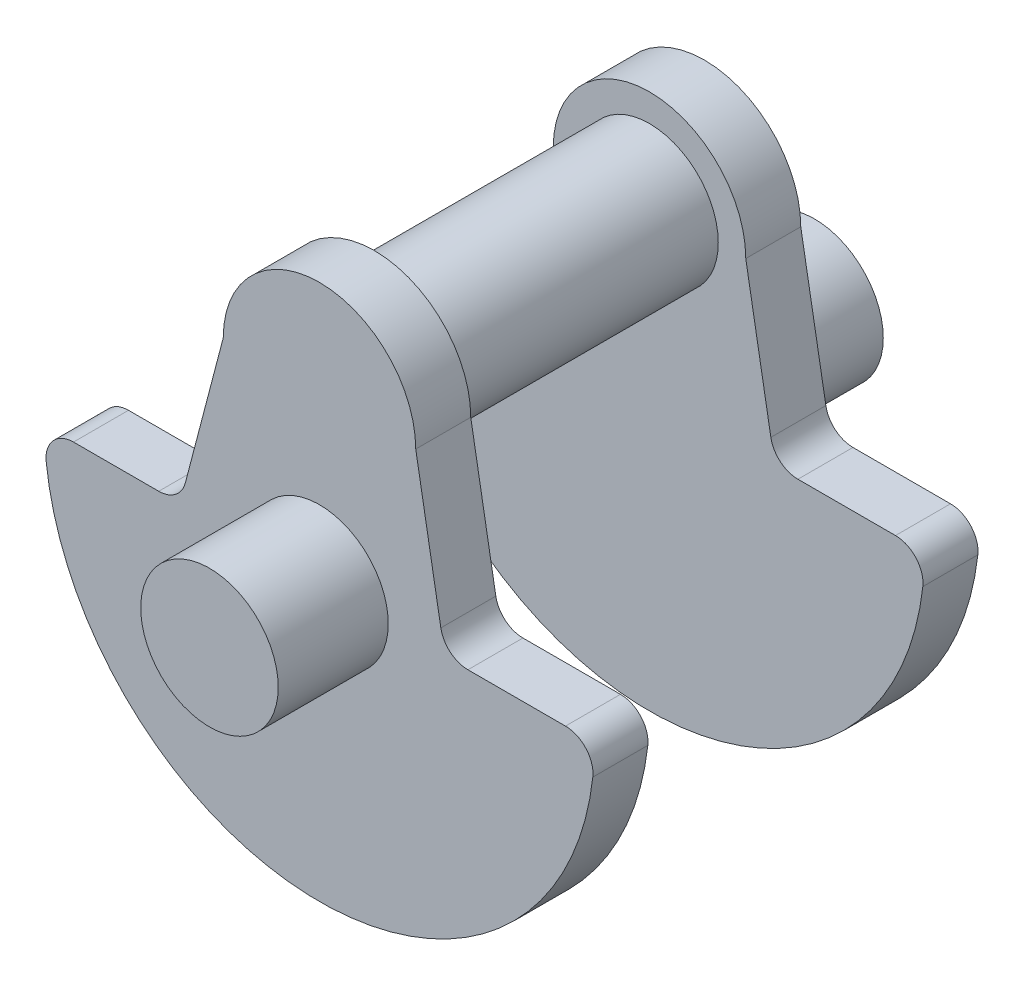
ISO-10303-21;
HEADER;
FILE_DESCRIPTION(('STEP AP214'),'2;1');
FILE_NAME('part.step','',(''),(''),'','','');
FILE_SCHEMA(('AUTOMOTIVE_DESIGN { 1 0 10303 214 1 1 1 1 }'));
ENDSEC;
DATA;
#1=APPLICATION_CONTEXT('core data for automotive mechanical design processes');
#2=APPLICATION_PROTOCOL_DEFINITION('international standard','automotive_design',2000,#1);
#3=PRODUCT_CONTEXT('',#1,'mechanical');
#4=PRODUCT('Part','Part','',(#3));
#5=PRODUCT_RELATED_PRODUCT_CATEGORY('part','',(#4));
#6=PRODUCT_DEFINITION_FORMATION('','',#4);
#7=PRODUCT_DEFINITION_CONTEXT('part definition',#1,'design');
#8=PRODUCT_DEFINITION('design','',#6,#7);
#9=PRODUCT_DEFINITION_SHAPE('','',#8);
#10=(LENGTH_UNIT() NAMED_UNIT(*) SI_UNIT(.MILLI.,.METRE.));
#11=(NAMED_UNIT(*) PLANE_ANGLE_UNIT() SI_UNIT($,.RADIAN.));
#12=(NAMED_UNIT(*) SI_UNIT($,.STERADIAN.) SOLID_ANGLE_UNIT());
#13=UNCERTAINTY_MEASURE_WITH_UNIT(LENGTH_MEASURE(1.E-05),#10,'distance_accuracy_value','');
#14=(GEOMETRIC_REPRESENTATION_CONTEXT(3) GLOBAL_UNCERTAINTY_ASSIGNED_CONTEXT((#13)) GLOBAL_UNIT_ASSIGNED_CONTEXT((#10,
#11,#12)) REPRESENTATION_CONTEXT('',''));
#15=CARTESIAN_POINT('',(0.,0.,0.));
#16=DIRECTION('',(0.,0.,1.));
#17=DIRECTION('',(1.,0.,0.));
#18=AXIS2_PLACEMENT_3D('',#15,#16,#17);
#19=CARTESIAN_POINT('',(0.,30.,-10.));
#20=DIRECTION('',(0.,0.,1.));
#21=DIRECTION('',(1.,0.,0.));
#22=AXIS2_PLACEMENT_3D('',#19,#20,#21);
#23=CYLINDRICAL_SURFACE('',#22,17.5);
#24=CARTESIAN_POINT('',(0.,30.,0.));
#25=DIRECTION('',(0.,0.,1.));
#26=DIRECTION('',(1.,0.,0.));
#27=AXIS2_PLACEMENT_3D('',#24,#25,#26);
#28=CIRCLE('',#27,17.5);
#29=CARTESIAN_POINT('',(17.5,30.,0.));
#30=VERTEX_POINT('',#29);
#31=CARTESIAN_POINT('',(-17.5,30.,0.));
#32=VERTEX_POINT('',#31);
#33=EDGE_CURVE('E232',#30,#32,#28,.T.);
#34=ORIENTED_EDGE('',*,*,#33,.F.);
#35=DIRECTION('',(0.,0.,1.));
#36=VECTOR('',#35,1.);
#37=CARTESIAN_POINT('',(17.5,30.,-10.));
#38=LINE('',#37,#36);
#39=CARTESIAN_POINT('',(17.5,30.,-10.));
#40=VERTEX_POINT('',#39);
#41=EDGE_CURVE('E272',#40,#30,#38,.T.);
#42=ORIENTED_EDGE('',*,*,#41,.F.);
#43=CARTESIAN_POINT('',(0.,30.,-10.));
#44=DIRECTION('',(0.,0.,1.));
#45=DIRECTION('',(1.,0.,0.));
#46=AXIS2_PLACEMENT_3D('',#43,#44,#45);
#47=CIRCLE('',#46,17.5);
#48=CARTESIAN_POINT('',(-17.5,30.,-10.));
#49=VERTEX_POINT('',#48);
#50=EDGE_CURVE('E238',#40,#49,#47,.T.);
#51=ORIENTED_EDGE('',*,*,#50,.T.);
#52=DIRECTION('',(0.,0.,1.));
#53=VECTOR('',#52,1.);
#54=CARTESIAN_POINT('',(-17.5,30.,-10.));
#55=LINE('',#54,#53);
#56=EDGE_CURVE('E256',#49,#32,#55,.T.);
#57=ORIENTED_EDGE('',*,*,#56,.T.);
#58=EDGE_LOOP('',(#34,#42,#51,#57));
#59=FACE_BOUND('',#58,.T.);
#60=ADVANCED_FACE('F38',(#59),#23,.T.);
#61=CARTESIAN_POINT('',(22.1026125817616,3.8972869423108,-10.));
#62=DIRECTION('',(0.984807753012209,0.173648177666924,0.));
#63=DIRECTION('',(-0.173648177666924,0.984807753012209,0.));
#64=AXIS2_PLACEMENT_3D('',#61,#62,#63);
#65=PLANE('',#64);
#66=DIRECTION('',(-0.173648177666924,0.984807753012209,0.));
#67=VECTOR('',#66,1.);
#68=CARTESIAN_POINT('',(22.1026125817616,3.8972869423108,0.));
#69=LINE('',#68,#67);
#70=CARTESIAN_POINT('',(22.0612688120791,4.13175911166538,0.));
#71=VERTEX_POINT('',#70);
#72=EDGE_CURVE('E242',#71,#30,#69,.T.);
#73=ORIENTED_EDGE('',*,*,#72,.F.);
#74=DIRECTION('',(0.,0.,1.));
#75=VECTOR('',#74,1.);
#76=CARTESIAN_POINT('',(22.0612688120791,4.13175911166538,-10.));
#77=LINE('',#76,#75);
#78=CARTESIAN_POINT('',(22.0612688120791,4.13175911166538,-10.));
#79=VERTEX_POINT('',#78);
#80=EDGE_CURVE('E302',#71,#79,#77,.F.);
#81=ORIENTED_EDGE('',*,*,#80,.T.);
#82=DIRECTION('',(-0.173648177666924,0.984807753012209,0.));
#83=VECTOR('',#82,1.);
#84=CARTESIAN_POINT('',(22.1026125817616,3.8972869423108,-10.));
#85=LINE('',#84,#83);
#86=EDGE_CURVE('E254',#79,#40,#85,.T.);
#87=ORIENTED_EDGE('',*,*,#86,.T.);
#88=ORIENTED_EDGE('',*,*,#41,.T.);
#89=EDGE_LOOP('',(#73,#81,#87,#88));
#90=FACE_BOUND('',#89,.T.);
#91=ADVANCED_FACE('F366',(#90),#65,.T.);
#92=CARTESIAN_POINT('',(0.,0.,-10.));
#93=DIRECTION('',(0.,1.,0.));
#94=DIRECTION('',(-1.,0.,0.));
#95=AXIS2_PLACEMENT_3D('',#92,#93,#94);
#96=PLANE('',#95);
#97=DIRECTION('',(-1.,0.,0.));
#98=VECTOR('',#97,1.);
#99=CARTESIAN_POINT('',(0.,0.,0.));
#100=LINE('',#99,#98);
#101=CARTESIAN_POINT('',(44.7213595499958,0.,0.));
#102=VERTEX_POINT('',#101);
#103=CARTESIAN_POINT('',(26.9853075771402,0.,0.));
#104=VERTEX_POINT('',#103);
#105=EDGE_CURVE('E268',#102,#104,#100,.T.);
#106=ORIENTED_EDGE('',*,*,#105,.F.);
#107=DIRECTION('',(0.,0.,1.));
#108=VECTOR('',#107,1.);
#109=CARTESIAN_POINT('',(44.7213595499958,0.,-10.));
#110=LINE('',#109,#108);
#111=CARTESIAN_POINT('',(44.7213595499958,0.,-10.));
#112=VERTEX_POINT('',#111);
#113=EDGE_CURVE('E296',#102,#112,#110,.F.);
#114=ORIENTED_EDGE('',*,*,#113,.T.);
#115=DIRECTION('',(-1.,0.,0.));
#116=VECTOR('',#115,1.);
#117=CARTESIAN_POINT('',(0.,0.,-10.));
#118=LINE('',#117,#116);
#119=CARTESIAN_POINT('',(26.9853075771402,0.,-10.));
#120=VERTEX_POINT('',#119);
#121=EDGE_CURVE('E251',#112,#120,#118,.T.);
#122=ORIENTED_EDGE('',*,*,#121,.T.);
#123=DIRECTION('',(0.,0.,1.));
#124=VECTOR('',#123,1.);
#125=CARTESIAN_POINT('',(26.9853075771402,0.,0.));
#126=LINE('',#125,#124);
#127=EDGE_CURVE('E293',#120,#104,#126,.T.);
#128=ORIENTED_EDGE('',*,*,#127,.T.);
#129=EDGE_LOOP('',(#106,#114,#122,#128));
#130=FACE_BOUND('',#129,.T.);
#131=ADVANCED_FACE('F372',(#130),#96,.T.);
#132=CARTESIAN_POINT('',(0.,0.,-10.));
#133=DIRECTION('',(0.,0.,1.));
#134=DIRECTION('',(1.,0.,0.));
#135=AXIS2_PLACEMENT_3D('',#132,#133,#134);
#136=CYLINDRICAL_SURFACE('',#135,50.);
#137=CARTESIAN_POINT('',(0.,0.,-10.));
#138=DIRECTION('',(0.,0.,1.));
#139=DIRECTION('',(1.,0.,0.));
#140=AXIS2_PLACEMENT_3D('',#137,#138,#139);
#141=CIRCLE('',#140,50.);
#142=CARTESIAN_POINT('',(-49.6903994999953,-5.55555555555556,-10.));
#143=VERTEX_POINT('',#142);
#144=CARTESIAN_POINT('',(49.6903994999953,-5.55555555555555,-10.));
#145=VERTEX_POINT('',#144);
#146=EDGE_CURVE('E248',#143,#145,#141,.T.);
#147=ORIENTED_EDGE('',*,*,#146,.T.);
#148=DIRECTION('',(0.,0.,1.));
#149=VECTOR('',#148,1.);
#150=CARTESIAN_POINT('',(49.6903994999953,-5.55555555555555,-10.));
#151=LINE('',#150,#149);
#152=CARTESIAN_POINT('',(49.6903994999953,-5.55555555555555,0.));
#153=VERTEX_POINT('',#152);
#154=EDGE_CURVE('E286',#145,#153,#151,.T.);
#155=ORIENTED_EDGE('',*,*,#154,.T.);
#156=CARTESIAN_POINT('',(0.,0.,0.));
#157=DIRECTION('',(0.,0.,1.));
#158=DIRECTION('',(1.,0.,0.));
#159=AXIS2_PLACEMENT_3D('',#156,#157,#158);
#160=CIRCLE('',#159,50.);
#161=CARTESIAN_POINT('',(-49.6903994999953,-5.55555555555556,0.));
#162=VERTEX_POINT('',#161);
#163=EDGE_CURVE('E265',#162,#153,#160,.T.);
#164=ORIENTED_EDGE('',*,*,#163,.F.);
#165=DIRECTION('',(0.,0.,1.));
#166=VECTOR('',#165,1.);
#167=CARTESIAN_POINT('',(-49.6903994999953,-5.55555555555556,-10.));
#168=LINE('',#167,#166);
#169=EDGE_CURVE('E284',#162,#143,#168,.F.);
#170=ORIENTED_EDGE('',*,*,#169,.T.);
#171=EDGE_LOOP('',(#147,#155,#164,#170));
#172=FACE_BOUND('',#171,.T.);
#173=ADVANCED_FACE('F456',(#172),#136,.T.);
#174=CARTESIAN_POINT('',(0.,0.,-10.));
#175=DIRECTION('',(0.,1.,0.));
#176=DIRECTION('',(-1.,0.,0.));
#177=AXIS2_PLACEMENT_3D('',#174,#175,#176);
#178=PLANE('',#177);
#179=DIRECTION('',(-1.,0.,0.));
#180=VECTOR('',#179,1.);
#181=CARTESIAN_POINT('',(0.,0.,0.));
#182=LINE('',#181,#180);
#183=CARTESIAN_POINT('',(-29.2245136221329,0.,0.));
#184=VERTEX_POINT('',#183);
#185=CARTESIAN_POINT('',(-44.7213595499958,0.,0.));
#186=VERTEX_POINT('',#185);
#187=EDGE_CURVE('E262',#184,#186,#182,.T.);
#188=ORIENTED_EDGE('',*,*,#187,.F.);
#189=DIRECTION('',(0.,0.,1.));
#190=VECTOR('',#189,1.);
#191=CARTESIAN_POINT('',(-29.2245136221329,0.,-10.));
#192=LINE('',#191,#190);
#193=CARTESIAN_POINT('',(-29.2245136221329,0.,-10.));
#194=VERTEX_POINT('',#193);
#195=EDGE_CURVE('E282',#184,#194,#192,.F.);
#196=ORIENTED_EDGE('',*,*,#195,.T.);
#197=DIRECTION('',(-1.,0.,0.));
#198=VECTOR('',#197,1.);
#199=CARTESIAN_POINT('',(0.,0.,-10.));
#200=LINE('',#199,#198);
#201=CARTESIAN_POINT('',(-44.7213595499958,0.,-10.));
#202=VERTEX_POINT('',#201);
#203=EDGE_CURVE('E245',#194,#202,#200,.T.);
#204=ORIENTED_EDGE('',*,*,#203,.T.);
#205=DIRECTION('',(0.,0.,1.));
#206=VECTOR('',#205,1.);
#207=CARTESIAN_POINT('',(-44.7213595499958,0.,-10.));
#208=LINE('',#207,#206);
#209=EDGE_CURVE('E279',#202,#186,#208,.T.);
#210=ORIENTED_EDGE('',*,*,#209,.T.);
#211=EDGE_LOOP('',(#188,#196,#204,#210));
#212=FACE_BOUND('',#211,.T.);
#213=ADVANCED_FACE('F459',(#212),#178,.T.);
#214=CARTESIAN_POINT('',(-23.7346062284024,6.22366385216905,-10.));
#215=DIRECTION('',(-0.967297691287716,0.253643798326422,0.));
#216=DIRECTION('',(-0.253643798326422,-0.967297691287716,0.));
#217=AXIS2_PLACEMENT_3D('',#214,#215,#216);
#218=PLANE('',#217);
#219=DIRECTION('',(-0.253643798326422,-0.967297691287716,0.));
#220=VECTOR('',#219,1.);
#221=CARTESIAN_POINT('',(-23.7346062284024,6.22366385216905,-10.));
#222=LINE('',#221,#220);
#223=CARTESIAN_POINT('',(-24.3880251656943,3.73178100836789,-10.));
#224=VERTEX_POINT('',#223);
#225=EDGE_CURVE('E241',#49,#224,#222,.T.);
#226=ORIENTED_EDGE('',*,*,#225,.T.);
#227=DIRECTION('',(0.,0.,1.));
#228=VECTOR('',#227,1.);
#229=CARTESIAN_POINT('',(-24.3880251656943,3.73178100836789,0.));
#230=LINE('',#229,#228);
#231=CARTESIAN_POINT('',(-24.3880251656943,3.73178100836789,0.));
#232=VERTEX_POINT('',#231);
#233=EDGE_CURVE('E275',#224,#232,#230,.T.);
#234=ORIENTED_EDGE('',*,*,#233,.T.);
#235=DIRECTION('',(-0.253643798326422,-0.967297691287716,0.));
#236=VECTOR('',#235,1.);
#237=CARTESIAN_POINT('',(-23.7346062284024,6.22366385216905,0.));
#238=LINE('',#237,#236);
#239=EDGE_CURVE('E259',#32,#232,#238,.T.);
#240=ORIENTED_EDGE('',*,*,#239,.F.);
#241=ORIENTED_EDGE('',*,*,#56,.F.);
#242=EDGE_LOOP('',(#226,#234,#240,#241));
#243=FACE_BOUND('',#242,.T.);
#244=ADVANCED_FACE('F378',(#243),#218,.T.);
#245=CARTESIAN_POINT('',(0.,0.,-10.));
#246=DIRECTION('',(0.,0.,1.));
#247=DIRECTION('',(1.,0.,0.));
#248=AXIS2_PLACEMENT_3D('',#245,#246,#247);
#249=PLANE('',#248);
#250=CARTESIAN_POINT('',(0.,30.,-10.));
#251=DIRECTION('',(0.,0.,1.));
#252=DIRECTION('',(1.,0.,0.));
#253=AXIS2_PLACEMENT_3D('',#250,#251,#252);
#254=CIRCLE('',#253,12.5);
#255=CARTESIAN_POINT('',(12.5,30.,-10.));
#256=VERTEX_POINT('',#255);
#257=EDGE_CURVE('E236',#256,#256,#254,.F.);
#258=ORIENTED_EDGE('',*,*,#257,.F.);
#259=EDGE_LOOP('',(#258));
#260=FACE_BOUND('',#259,.T.);
#261=ORIENTED_EDGE('',*,*,#121,.F.);
#262=CARTESIAN_POINT('',(44.7213595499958,-5.,-10.));
#263=DIRECTION('',(0.,0.,1.));
#264=DIRECTION('',(1.,0.,0.));
#265=AXIS2_PLACEMENT_3D('',#262,#263,#264);
#266=CIRCLE('',#265,5.);
#267=EDGE_CURVE('E300',#112,#145,#266,.F.);
#268=ORIENTED_EDGE('',*,*,#267,.T.);
#269=ORIENTED_EDGE('',*,*,#146,.F.);
#270=CARTESIAN_POINT('',(-44.7213595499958,-5.00000000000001,-10.));
#271=DIRECTION('',(0.,0.,1.));
#272=DIRECTION('',(1.,0.,0.));
#273=AXIS2_PLACEMENT_3D('',#270,#271,#272);
#274=CIRCLE('',#273,5.);
#275=EDGE_CURVE('E298',#143,#202,#274,.F.);
#276=ORIENTED_EDGE('',*,*,#275,.T.);
#277=ORIENTED_EDGE('',*,*,#203,.F.);
#278=CARTESIAN_POINT('',(-29.2245136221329,5.,-10.));
#279=DIRECTION('',(0.,0.,1.));
#280=DIRECTION('',(1.,0.,0.));
#281=AXIS2_PLACEMENT_3D('',#278,#279,#280);
#282=CIRCLE('',#281,5.);
#283=EDGE_CURVE('E306',#194,#224,#282,.T.);
#284=ORIENTED_EDGE('',*,*,#283,.T.);
#285=ORIENTED_EDGE('',*,*,#225,.F.);
#286=ORIENTED_EDGE('',*,*,#50,.F.);
#287=ORIENTED_EDGE('',*,*,#86,.F.);
#288=CARTESIAN_POINT('',(26.9853075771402,5.,-10.));
#289=DIRECTION('',(0.,0.,1.));
#290=DIRECTION('',(1.,0.,0.));
#291=AXIS2_PLACEMENT_3D('',#288,#289,#290);
#292=CIRCLE('',#291,5.);
#293=EDGE_CURVE('E237',#79,#120,#292,.T.);
#294=ORIENTED_EDGE('',*,*,#293,.T.);
#295=EDGE_LOOP('',(#261,#268,#269,#276,#277,#284,#285,#286,#287,#294));
#296=FACE_BOUND('',#295,.T.);
#297=ADVANCED_FACE('F447',(#260,#296),#249,.F.);
#298=CARTESIAN_POINT('',(0.,0.,0.));
#299=DIRECTION('',(0.,0.,1.));
#300=DIRECTION('',(1.,0.,0.));
#301=AXIS2_PLACEMENT_3D('',#298,#299,#300);
#302=PLANE('',#301);
#303=CARTESIAN_POINT('',(0.,0.,0.));
#304=DIRECTION('',(0.,0.,1.));
#305=DIRECTION('',(1.,0.,0.));
#306=AXIS2_PLACEMENT_3D('',#303,#304,#305);
#307=CIRCLE('',#306,12.5);
#308=CARTESIAN_POINT('',(12.5,0.,0.));
#309=VERTEX_POINT('',#308);
#310=EDGE_CURVE('E233',#309,#309,#307,.T.);
#311=ORIENTED_EDGE('',*,*,#310,.F.);
#312=EDGE_LOOP('',(#311));
#313=FACE_BOUND('',#312,.T.);
#314=ORIENTED_EDGE('',*,*,#163,.T.);
#315=CARTESIAN_POINT('',(44.7213595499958,-5.,0.));
#316=DIRECTION('',(0.,0.,1.));
#317=DIRECTION('',(1.,0.,0.));
#318=AXIS2_PLACEMENT_3D('',#315,#316,#317);
#319=CIRCLE('',#318,5.);
#320=EDGE_CURVE('E291',#153,#102,#319,.T.);
#321=ORIENTED_EDGE('',*,*,#320,.T.);
#322=ORIENTED_EDGE('',*,*,#105,.T.);
#323=CARTESIAN_POINT('',(26.9853075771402,5.,0.));
#324=DIRECTION('',(0.,0.,1.));
#325=DIRECTION('',(1.,0.,0.));
#326=AXIS2_PLACEMENT_3D('',#323,#324,#325);
#327=CIRCLE('',#326,5.);
#328=EDGE_CURVE('E308',#104,#71,#327,.F.);
#329=ORIENTED_EDGE('',*,*,#328,.T.);
#330=ORIENTED_EDGE('',*,*,#72,.T.);
#331=ORIENTED_EDGE('',*,*,#33,.T.);
#332=ORIENTED_EDGE('',*,*,#239,.T.);
#333=CARTESIAN_POINT('',(-29.2245136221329,5.,0.));
#334=DIRECTION('',(0.,0.,1.));
#335=DIRECTION('',(1.,0.,0.));
#336=AXIS2_PLACEMENT_3D('',#333,#334,#335);
#337=CIRCLE('',#336,5.);
#338=EDGE_CURVE('E304',#232,#184,#337,.F.);
#339=ORIENTED_EDGE('',*,*,#338,.T.);
#340=ORIENTED_EDGE('',*,*,#187,.T.);
#341=CARTESIAN_POINT('',(-44.7213595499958,-5.00000000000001,0.));
#342=DIRECTION('',(0.,0.,1.));
#343=DIRECTION('',(1.,0.,0.));
#344=AXIS2_PLACEMENT_3D('',#341,#342,#343);
#345=CIRCLE('',#344,5.);
#346=EDGE_CURVE('E289',#186,#162,#345,.T.);
#347=ORIENTED_EDGE('',*,*,#346,.T.);
#348=EDGE_LOOP('',(#314,#321,#322,#329,#330,#331,#332,#339,#340,#347));
#349=FACE_BOUND('',#348,.T.);
#350=ADVANCED_FACE('F384',(#313,#349),#302,.T.);
#351=CARTESIAN_POINT('',(-29.2245136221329,5.,-10.));
#352=DIRECTION('',(0.,0.,-1.));
#353=DIRECTION('',(-1.,0.,0.));
#354=AXIS2_PLACEMENT_3D('',#351,#352,#353);
#355=CYLINDRICAL_SURFACE('',#354,5.);
#356=ORIENTED_EDGE('',*,*,#283,.F.);
#357=ORIENTED_EDGE('',*,*,#195,.F.);
#358=ORIENTED_EDGE('',*,*,#338,.F.);
#359=ORIENTED_EDGE('',*,*,#233,.F.);
#360=EDGE_LOOP('',(#356,#357,#358,#359));
#361=FACE_BOUND('',#360,.T.);
#362=ADVANCED_FACE('F380',(#361),#355,.F.);
#363=CARTESIAN_POINT('',(44.7213595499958,-5.,-10.));
#364=DIRECTION('',(0.,0.,1.));
#365=DIRECTION('',(1.,0.,0.));
#366=AXIS2_PLACEMENT_3D('',#363,#364,#365);
#367=CYLINDRICAL_SURFACE('',#366,5.);
#368=ORIENTED_EDGE('',*,*,#267,.F.);
#369=ORIENTED_EDGE('',*,*,#113,.F.);
#370=ORIENTED_EDGE('',*,*,#320,.F.);
#371=ORIENTED_EDGE('',*,*,#154,.F.);
#372=EDGE_LOOP('',(#368,#369,#370,#371));
#373=FACE_BOUND('',#372,.T.);
#374=ADVANCED_FACE('F383',(#373),#367,.T.);
#375=CARTESIAN_POINT('',(26.9853075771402,5.,-10.));
#376=DIRECTION('',(0.,0.,-1.));
#377=DIRECTION('',(-1.,0.,0.));
#378=AXIS2_PLACEMENT_3D('',#375,#376,#377);
#379=CYLINDRICAL_SURFACE('',#378,5.);
#380=ORIENTED_EDGE('',*,*,#293,.F.);
#381=ORIENTED_EDGE('',*,*,#80,.F.);
#382=ORIENTED_EDGE('',*,*,#328,.F.);
#383=ORIENTED_EDGE('',*,*,#127,.F.);
#384=EDGE_LOOP('',(#380,#381,#382,#383));
#385=FACE_BOUND('',#384,.T.);
#386=ADVANCED_FACE('F388',(#385),#379,.F.);
#387=CARTESIAN_POINT('',(-44.7213595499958,-5.00000000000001,-10.));
#388=DIRECTION('',(0.,0.,1.));
#389=DIRECTION('',(1.,0.,0.));
#390=AXIS2_PLACEMENT_3D('',#387,#388,#389);
#391=CYLINDRICAL_SURFACE('',#390,5.);
#392=ORIENTED_EDGE('',*,*,#275,.F.);
#393=ORIENTED_EDGE('',*,*,#169,.F.);
#394=ORIENTED_EDGE('',*,*,#346,.F.);
#395=ORIENTED_EDGE('',*,*,#209,.F.);
#396=EDGE_LOOP('',(#392,#393,#394,#395));
#397=FACE_BOUND('',#396,.T.);
#398=ADVANCED_FACE('F392',(#397),#391,.T.);
#399=CARTESIAN_POINT('',(0.,0.,20.));
#400=DIRECTION('',(0.,0.,-1.));
#401=DIRECTION('',(-1.,0.,0.));
#402=AXIS2_PLACEMENT_3D('',#399,#400,#401);
#403=CYLINDRICAL_SURFACE('',#402,12.5);
#404=CARTESIAN_POINT('',(0.,0.,20.));
#405=DIRECTION('',(0.,0.,1.));
#406=DIRECTION('',(1.,0.,0.));
#407=AXIS2_PLACEMENT_3D('',#404,#405,#406);
#408=CIRCLE('',#407,12.5);
#409=CARTESIAN_POINT('',(12.5,0.,20.));
#410=VERTEX_POINT('',#409);
#411=EDGE_CURVE('E229',#410,#410,#408,.T.);
#412=ORIENTED_EDGE('',*,*,#411,.F.);
#413=EDGE_LOOP('',(#412));
#414=FACE_BOUND('',#413,.T.);
#415=ORIENTED_EDGE('',*,*,#310,.T.);
#416=EDGE_LOOP('',(#415));
#417=FACE_BOUND('',#416,.T.);
#418=ADVANCED_FACE('F396',(#414,#417),#403,.T.);
#419=CARTESIAN_POINT('',(0.,0.,20.));
#420=DIRECTION('',(0.,0.,1.));
#421=DIRECTION('',(1.,0.,0.));
#422=AXIS2_PLACEMENT_3D('',#419,#420,#421);
#423=PLANE('',#422);
#424=ORIENTED_EDGE('',*,*,#411,.T.);
#425=EDGE_LOOP('',(#424));
#426=FACE_BOUND('',#425,.T.);
#427=ADVANCED_FACE('F439',(#426),#423,.T.);
#428=CARTESIAN_POINT('',(0.,30.,-60.));
#429=DIRECTION('',(0.,0.,1.));
#430=DIRECTION('',(1.,0.,0.));
#431=AXIS2_PLACEMENT_3D('',#428,#429,#430);
#432=CYLINDRICAL_SURFACE('',#431,12.5);
#433=CARTESIAN_POINT('',(0.,30.,-60.));
#434=DIRECTION('',(0.,0.,-1.));
#435=DIRECTION('',(-1.,0.,0.));
#436=AXIS2_PLACEMENT_3D('',#433,#434,#435);
#437=CIRCLE('',#436,12.5);
#438=CARTESIAN_POINT('',(-12.5,30.,-60.));
#439=VERTEX_POINT('',#438);
#440=EDGE_CURVE('E225',#439,#439,#437,.T.);
#441=ORIENTED_EDGE('',*,*,#440,.F.);
#442=EDGE_LOOP('',(#441));
#443=FACE_BOUND('',#442,.T.);
#444=ORIENTED_EDGE('',*,*,#257,.T.);
#445=EDGE_LOOP('',(#444));
#446=FACE_BOUND('',#445,.T.);
#447=ADVANCED_FACE('F427',(#443,#446),#432,.T.);
#448=CARTESIAN_POINT('',(0.,30.,-60.));
#449=DIRECTION('',(0.,0.,-1.));
#450=DIRECTION('',(-1.,0.,0.));
#451=AXIS2_PLACEMENT_3D('',#448,#449,#450);
#452=CYLINDRICAL_SURFACE('',#451,17.5);
#453=CARTESIAN_POINT('',(0.,30.,-70.));
#454=DIRECTION('',(0.,0.,1.));
#455=DIRECTION('',(1.,0.,0.));
#456=AXIS2_PLACEMENT_3D('',#453,#454,#455);
#457=CIRCLE('',#456,17.5);
#458=CARTESIAN_POINT('',(17.5,30.,-70.));
#459=VERTEX_POINT('',#458);
#460=CARTESIAN_POINT('',(-17.5,30.,-70.));
#461=VERTEX_POINT('',#460);
#462=EDGE_CURVE('E215',#459,#461,#457,.T.);
#463=ORIENTED_EDGE('',*,*,#462,.T.);
#464=DIRECTION('',(0.,0.,-1.));
#465=VECTOR('',#464,1.);
#466=CARTESIAN_POINT('',(-17.5,30.,-60.));
#467=LINE('',#466,#465);
#468=CARTESIAN_POINT('',(-17.5,30.,-60.));
#469=VERTEX_POINT('',#468);
#470=EDGE_CURVE('E195',#469,#461,#467,.T.);
#471=ORIENTED_EDGE('',*,*,#470,.F.);
#472=CARTESIAN_POINT('',(0.,30.,-60.));
#473=DIRECTION('',(0.,0.,1.));
#474=DIRECTION('',(1.,0.,0.));
#475=AXIS2_PLACEMENT_3D('',#472,#473,#474);
#476=CIRCLE('',#475,17.5);
#477=CARTESIAN_POINT('',(17.5,30.,-60.));
#478=VERTEX_POINT('',#477);
#479=EDGE_CURVE('E180',#478,#469,#476,.T.);
#480=ORIENTED_EDGE('',*,*,#479,.F.);
#481=DIRECTION('',(0.,0.,-1.));
#482=VECTOR('',#481,1.);
#483=CARTESIAN_POINT('',(17.5,30.,-60.));
#484=LINE('',#483,#482);
#485=EDGE_CURVE('E188',#478,#459,#484,.T.);
#486=ORIENTED_EDGE('',*,*,#485,.T.);
#487=EDGE_LOOP('',(#463,#471,#480,#486));
#488=FACE_BOUND('',#487,.T.);
#489=ADVANCED_FACE('F198',(#488),#452,.T.);
#490=CARTESIAN_POINT('',(-23.7346062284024,6.22366385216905,-60.));
#491=DIRECTION('',(0.967297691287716,-0.253643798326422,0.));
#492=DIRECTION('',(0.253643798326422,0.967297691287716,0.));
#493=AXIS2_PLACEMENT_3D('',#490,#491,#492);
#494=PLANE('',#493);
#495=DIRECTION('',(-0.253643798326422,-0.967297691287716,0.));
#496=VECTOR('',#495,1.);
#497=CARTESIAN_POINT('',(-23.7346062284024,6.22366385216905,-70.));
#498=LINE('',#497,#496);
#499=CARTESIAN_POINT('',(-24.3880251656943,3.73178100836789,-70.));
#500=VERTEX_POINT('',#499);
#501=EDGE_CURVE('E200',#461,#500,#498,.T.);
#502=ORIENTED_EDGE('',*,*,#501,.T.);
#503=DIRECTION('',(0.,0.,-1.));
#504=VECTOR('',#503,1.);
#505=CARTESIAN_POINT('',(-24.3880251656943,3.73178100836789,-60.));
#506=LINE('',#505,#504);
#507=CARTESIAN_POINT('',(-24.3880251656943,3.73178100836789,-60.));
#508=VERTEX_POINT('',#507);
#509=EDGE_CURVE('E318',#500,#508,#506,.F.);
#510=ORIENTED_EDGE('',*,*,#509,.T.);
#511=DIRECTION('',(-0.253643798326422,-0.967297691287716,0.));
#512=VECTOR('',#511,1.);
#513=CARTESIAN_POINT('',(-23.7346062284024,6.22366385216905,-60.));
#514=LINE('',#513,#512);
#515=EDGE_CURVE('E196',#469,#508,#514,.T.);
#516=ORIENTED_EDGE('',*,*,#515,.F.);
#517=ORIENTED_EDGE('',*,*,#470,.T.);
#518=EDGE_LOOP('',(#502,#510,#516,#517));
#519=FACE_BOUND('',#518,.T.);
#520=ADVANCED_FACE('F419',(#519),#494,.F.);
#521=CARTESIAN_POINT('',(0.,0.,-60.));
#522=DIRECTION('',(0.,-1.,0.));
#523=DIRECTION('',(1.,0.,0.));
#524=AXIS2_PLACEMENT_3D('',#521,#522,#523);
#525=PLANE('',#524);
#526=DIRECTION('',(-1.,0.,0.));
#527=VECTOR('',#526,1.);
#528=CARTESIAN_POINT('',(0.,0.,-60.));
#529=LINE('',#528,#527);
#530=CARTESIAN_POINT('',(-29.2245136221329,0.,-60.));
#531=VERTEX_POINT('',#530);
#532=CARTESIAN_POINT('',(-44.7213595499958,0.,-60.));
#533=VERTEX_POINT('',#532);
#534=EDGE_CURVE('E211',#531,#533,#529,.T.);
#535=ORIENTED_EDGE('',*,*,#534,.F.);
#536=DIRECTION('',(0.,0.,-1.));
#537=VECTOR('',#536,1.);
#538=CARTESIAN_POINT('',(-29.2245136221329,0.,-70.));
#539=LINE('',#538,#537);
#540=CARTESIAN_POINT('',(-29.2245136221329,0.,-70.));
#541=VERTEX_POINT('',#540);
#542=EDGE_CURVE('E315',#531,#541,#539,.T.);
#543=ORIENTED_EDGE('',*,*,#542,.T.);
#544=DIRECTION('',(-1.,0.,0.));
#545=VECTOR('',#544,1.);
#546=CARTESIAN_POINT('',(0.,0.,-70.));
#547=LINE('',#546,#545);
#548=CARTESIAN_POINT('',(-44.7213595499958,0.,-70.));
#549=VERTEX_POINT('',#548);
#550=EDGE_CURVE('E203',#541,#549,#547,.T.);
#551=ORIENTED_EDGE('',*,*,#550,.T.);
#552=DIRECTION('',(0.,0.,-1.));
#553=VECTOR('',#552,1.);
#554=CARTESIAN_POINT('',(-44.7213595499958,0.,-60.));
#555=LINE('',#554,#553);
#556=EDGE_CURVE('E313',#549,#533,#555,.F.);
#557=ORIENTED_EDGE('',*,*,#556,.T.);
#558=EDGE_LOOP('',(#535,#543,#551,#557));
#559=FACE_BOUND('',#558,.T.);
#560=ADVANCED_FACE('F411',(#559),#525,.F.);
#561=CARTESIAN_POINT('',(0.,0.,-60.));
#562=DIRECTION('',(0.,0.,-1.));
#563=DIRECTION('',(-1.,0.,0.));
#564=AXIS2_PLACEMENT_3D('',#561,#562,#563);
#565=CYLINDRICAL_SURFACE('',#564,50.);
#566=CARTESIAN_POINT('',(0.,0.,-70.));
#567=DIRECTION('',(0.,0.,1.));
#568=DIRECTION('',(1.,0.,0.));
#569=AXIS2_PLACEMENT_3D('',#566,#567,#568);
#570=CIRCLE('',#569,50.);
#571=CARTESIAN_POINT('',(-49.6903994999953,-5.55555555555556,-70.));
#572=VERTEX_POINT('',#571);
#573=CARTESIAN_POINT('',(49.6903994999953,-5.55555555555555,-70.));
#574=VERTEX_POINT('',#573);
#575=EDGE_CURVE('E221',#572,#574,#570,.T.);
#576=ORIENTED_EDGE('',*,*,#575,.T.);
#577=DIRECTION('',(0.,0.,-1.));
#578=VECTOR('',#577,1.);
#579=CARTESIAN_POINT('',(49.6903994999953,-5.55555555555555,-60.));
#580=LINE('',#579,#578);
#581=CARTESIAN_POINT('',(49.6903994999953,-5.55555555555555,-60.));
#582=VERTEX_POINT('',#581);
#583=EDGE_CURVE('E60',#574,#582,#580,.F.);
#584=ORIENTED_EDGE('',*,*,#583,.T.);
#585=CARTESIAN_POINT('',(0.,0.,-60.));
#586=DIRECTION('',(0.,0.,1.));
#587=DIRECTION('',(1.,0.,0.));
#588=AXIS2_PLACEMENT_3D('',#585,#586,#587);
#589=CIRCLE('',#588,50.);
#590=CARTESIAN_POINT('',(-49.6903994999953,-5.55555555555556,-60.));
#591=VERTEX_POINT('',#590);
#592=EDGE_CURVE('E209',#591,#582,#589,.T.);
#593=ORIENTED_EDGE('',*,*,#592,.F.);
#594=DIRECTION('',(0.,0.,-1.));
#595=VECTOR('',#594,1.);
#596=CARTESIAN_POINT('',(-49.6903994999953,-5.55555555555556,-60.));
#597=LINE('',#596,#595);
#598=EDGE_CURVE('E329',#591,#572,#597,.T.);
#599=ORIENTED_EDGE('',*,*,#598,.T.);
#600=EDGE_LOOP('',(#576,#584,#593,#599));
#601=FACE_BOUND('',#600,.T.);
#602=ADVANCED_FACE('F416',(#601),#565,.T.);
#603=CARTESIAN_POINT('',(0.,0.,-60.));
#604=DIRECTION('',(0.,-1.,0.));
#605=DIRECTION('',(1.,0.,0.));
#606=AXIS2_PLACEMENT_3D('',#603,#604,#605);
#607=PLANE('',#606);
#608=DIRECTION('',(-1.,0.,0.));
#609=VECTOR('',#608,1.);
#610=CARTESIAN_POINT('',(0.,0.,-60.));
#611=LINE('',#610,#609);
#612=CARTESIAN_POINT('',(44.7213595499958,0.,-60.));
#613=VERTEX_POINT('',#612);
#614=CARTESIAN_POINT('',(26.9853075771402,0.,-60.));
#615=VERTEX_POINT('',#614);
#616=EDGE_CURVE('E185',#613,#615,#611,.T.);
#617=ORIENTED_EDGE('',*,*,#616,.F.);
#618=DIRECTION('',(0.,0.,-1.));
#619=VECTOR('',#618,1.);
#620=CARTESIAN_POINT('',(44.7213595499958,0.,-60.));
#621=LINE('',#620,#619);
#622=CARTESIAN_POINT('',(44.7213595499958,0.,-70.));
#623=VERTEX_POINT('',#622);
#624=EDGE_CURVE('E322',#613,#623,#621,.T.);
#625=ORIENTED_EDGE('',*,*,#624,.T.);
#626=DIRECTION('',(-1.,0.,0.));
#627=VECTOR('',#626,1.);
#628=CARTESIAN_POINT('',(0.,0.,-70.));
#629=LINE('',#628,#627);
#630=CARTESIAN_POINT('',(26.9853075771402,0.,-70.));
#631=VERTEX_POINT('',#630);
#632=EDGE_CURVE('E218',#623,#631,#629,.T.);
#633=ORIENTED_EDGE('',*,*,#632,.T.);
#634=DIRECTION('',(0.,0.,-1.));
#635=VECTOR('',#634,1.);
#636=CARTESIAN_POINT('',(26.9853075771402,0.,-60.));
#637=LINE('',#636,#635);
#638=EDGE_CURVE('E320',#631,#615,#637,.F.);
#639=ORIENTED_EDGE('',*,*,#638,.T.);
#640=EDGE_LOOP('',(#617,#625,#633,#639));
#641=FACE_BOUND('',#640,.T.);
#642=ADVANCED_FACE('F351',(#641),#607,.F.);
#643=CARTESIAN_POINT('',(22.1026125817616,3.8972869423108,-60.));
#644=DIRECTION('',(-0.984807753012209,-0.173648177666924,0.));
#645=DIRECTION('',(0.173648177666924,-0.984807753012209,0.));
#646=AXIS2_PLACEMENT_3D('',#643,#644,#645);
#647=PLANE('',#646);
#648=DIRECTION('',(-0.173648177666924,0.984807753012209,0.));
#649=VECTOR('',#648,1.);
#650=CARTESIAN_POINT('',(22.1026125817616,3.8972869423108,-60.));
#651=LINE('',#650,#649);
#652=CARTESIAN_POINT('',(22.0612688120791,4.13175911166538,-60.));
#653=VERTEX_POINT('',#652);
#654=EDGE_CURVE('E175',#653,#478,#651,.T.);
#655=ORIENTED_EDGE('',*,*,#654,.F.);
#656=DIRECTION('',(0.,0.,-1.));
#657=VECTOR('',#656,1.);
#658=CARTESIAN_POINT('',(22.0612688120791,4.13175911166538,-70.));
#659=LINE('',#658,#657);
#660=CARTESIAN_POINT('',(22.0612688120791,4.13175911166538,-70.));
#661=VERTEX_POINT('',#660);
#662=EDGE_CURVE('E337',#653,#661,#659,.T.);
#663=ORIENTED_EDGE('',*,*,#662,.T.);
#664=DIRECTION('',(-0.173648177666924,0.984807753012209,0.));
#665=VECTOR('',#664,1.);
#666=CARTESIAN_POINT('',(22.1026125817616,3.8972869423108,-70.));
#667=LINE('',#666,#665);
#668=EDGE_CURVE('E191',#661,#459,#667,.T.);
#669=ORIENTED_EDGE('',*,*,#668,.T.);
#670=ORIENTED_EDGE('',*,*,#485,.F.);
#671=EDGE_LOOP('',(#655,#663,#669,#670));
#672=FACE_BOUND('',#671,.T.);
#673=ADVANCED_FACE('F189',(#672),#647,.F.);
#674=CARTESIAN_POINT('',(0.,0.,-60.));
#675=DIRECTION('',(0.,0.,-1.));
#676=DIRECTION('',(1.,0.,0.));
#677=AXIS2_PLACEMENT_3D('',#674,#675,#676);
#678=PLANE('',#677);
#679=ORIENTED_EDGE('',*,*,#440,.T.);
#680=EDGE_LOOP('',(#679));
#681=FACE_BOUND('',#680,.T.);
#682=ORIENTED_EDGE('',*,*,#592,.T.);
#683=CARTESIAN_POINT('',(44.7213595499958,-5.,-60.));
#684=DIRECTION('',(0.,0.,-1.));
#685=DIRECTION('',(-1.,0.,0.));
#686=AXIS2_PLACEMENT_3D('',#683,#684,#685);
#687=CIRCLE('',#686,5.);
#688=EDGE_CURVE('E335',#582,#613,#687,.F.);
#689=ORIENTED_EDGE('',*,*,#688,.T.);
#690=ORIENTED_EDGE('',*,*,#616,.T.);
#691=CARTESIAN_POINT('',(26.9853075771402,5.,-60.));
#692=DIRECTION('',(0.,0.,-1.));
#693=DIRECTION('',(-1.,0.,0.));
#694=AXIS2_PLACEMENT_3D('',#691,#692,#693);
#695=CIRCLE('',#694,5.);
#696=EDGE_CURVE('E46',#615,#653,#695,.T.);
#697=ORIENTED_EDGE('',*,*,#696,.T.);
#698=ORIENTED_EDGE('',*,*,#654,.T.);
#699=ORIENTED_EDGE('',*,*,#479,.T.);
#700=ORIENTED_EDGE('',*,*,#515,.T.);
#701=CARTESIAN_POINT('',(-29.2245136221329,5.,-60.));
#702=DIRECTION('',(0.,0.,-1.));
#703=DIRECTION('',(-1.,0.,0.));
#704=AXIS2_PLACEMENT_3D('',#701,#702,#703);
#705=CIRCLE('',#704,5.);
#706=EDGE_CURVE('E341',#508,#531,#705,.T.);
#707=ORIENTED_EDGE('',*,*,#706,.T.);
#708=ORIENTED_EDGE('',*,*,#534,.T.);
#709=CARTESIAN_POINT('',(-44.7213595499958,-5.00000000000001,-60.));
#710=DIRECTION('',(0.,0.,-1.));
#711=DIRECTION('',(-1.,0.,0.));
#712=AXIS2_PLACEMENT_3D('',#709,#710,#711);
#713=CIRCLE('',#712,5.);
#714=EDGE_CURVE('E333',#533,#591,#713,.F.);
#715=ORIENTED_EDGE('',*,*,#714,.T.);
#716=EDGE_LOOP('',(#682,#689,#690,#697,#698,#699,#700,#707,#708,#715));
#717=FACE_BOUND('',#716,.T.);
#718=ADVANCED_FACE('F177',(#681,#717),#678,.F.);
#719=CARTESIAN_POINT('',(0.,0.,-70.));
#720=DIRECTION('',(0.,0.,-1.));
#721=DIRECTION('',(1.,0.,0.));
#722=AXIS2_PLACEMENT_3D('',#719,#720,#721);
#723=PLANE('',#722);
#724=CARTESIAN_POINT('',(0.,0.,-70.));
#725=DIRECTION('',(0.,0.,-1.));
#726=DIRECTION('',(-1.,0.,0.));
#727=AXIS2_PLACEMENT_3D('',#724,#725,#726);
#728=CIRCLE('',#727,12.5);
#729=CARTESIAN_POINT('',(-12.5,0.,-70.));
#730=VERTEX_POINT('',#729);
#731=EDGE_CURVE('E11',#730,#730,#728,.T.);
#732=ORIENTED_EDGE('',*,*,#731,.F.);
#733=EDGE_LOOP('',(#732));
#734=FACE_BOUND('',#733,.T.);
#735=ORIENTED_EDGE('',*,*,#632,.F.);
#736=CARTESIAN_POINT('',(44.7213595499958,-5.,-70.));
#737=DIRECTION('',(0.,0.,-1.));
#738=DIRECTION('',(-1.,0.,0.));
#739=AXIS2_PLACEMENT_3D('',#736,#737,#738);
#740=CIRCLE('',#739,5.);
#741=EDGE_CURVE('E327',#623,#574,#740,.T.);
#742=ORIENTED_EDGE('',*,*,#741,.T.);
#743=ORIENTED_EDGE('',*,*,#575,.F.);
#744=CARTESIAN_POINT('',(-44.7213595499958,-5.00000000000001,-70.));
#745=DIRECTION('',(0.,0.,-1.));
#746=DIRECTION('',(-1.,0.,0.));
#747=AXIS2_PLACEMENT_3D('',#744,#745,#746);
#748=CIRCLE('',#747,5.);
#749=EDGE_CURVE('E325',#572,#549,#748,.T.);
#750=ORIENTED_EDGE('',*,*,#749,.T.);
#751=ORIENTED_EDGE('',*,*,#550,.F.);
#752=CARTESIAN_POINT('',(-29.2245136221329,5.,-70.));
#753=DIRECTION('',(0.,0.,-1.));
#754=DIRECTION('',(-1.,0.,0.));
#755=AXIS2_PLACEMENT_3D('',#752,#753,#754);
#756=CIRCLE('',#755,5.);
#757=EDGE_CURVE('E339',#541,#500,#756,.F.);
#758=ORIENTED_EDGE('',*,*,#757,.T.);
#759=ORIENTED_EDGE('',*,*,#501,.F.);
#760=ORIENTED_EDGE('',*,*,#462,.F.);
#761=ORIENTED_EDGE('',*,*,#668,.F.);
#762=CARTESIAN_POINT('',(26.9853075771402,5.,-70.));
#763=DIRECTION('',(0.,0.,-1.));
#764=DIRECTION('',(-1.,0.,0.));
#765=AXIS2_PLACEMENT_3D('',#762,#763,#764);
#766=CIRCLE('',#765,5.);
#767=EDGE_CURVE('E343',#661,#631,#766,.F.);
#768=ORIENTED_EDGE('',*,*,#767,.T.);
#769=EDGE_LOOP('',(#735,#742,#743,#750,#751,#758,#759,#760,#761,#768));
#770=FACE_BOUND('',#769,.T.);
#771=ADVANCED_FACE('F346',(#734,#770),#723,.T.);
#772=CARTESIAN_POINT('',(-29.2245136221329,5.,-60.));
#773=DIRECTION('',(0.,0.,1.));
#774=DIRECTION('',(1.,0.,0.));
#775=AXIS2_PLACEMENT_3D('',#772,#773,#774);
#776=CYLINDRICAL_SURFACE('',#775,5.);
#777=ORIENTED_EDGE('',*,*,#706,.F.);
#778=ORIENTED_EDGE('',*,*,#509,.F.);
#779=ORIENTED_EDGE('',*,*,#757,.F.);
#780=ORIENTED_EDGE('',*,*,#542,.F.);
#781=EDGE_LOOP('',(#777,#778,#779,#780));
#782=FACE_BOUND('',#781,.T.);
#783=ADVANCED_FACE('F362',(#782),#776,.F.);
#784=CARTESIAN_POINT('',(44.7213595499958,-5.,-60.));
#785=DIRECTION('',(0.,0.,-1.));
#786=DIRECTION('',(-1.,0.,0.));
#787=AXIS2_PLACEMENT_3D('',#784,#785,#786);
#788=CYLINDRICAL_SURFACE('',#787,5.);
#789=ORIENTED_EDGE('',*,*,#688,.F.);
#790=ORIENTED_EDGE('',*,*,#583,.F.);
#791=ORIENTED_EDGE('',*,*,#741,.F.);
#792=ORIENTED_EDGE('',*,*,#624,.F.);
#793=EDGE_LOOP('',(#789,#790,#791,#792));
#794=FACE_BOUND('',#793,.T.);
#795=ADVANCED_FACE('F355',(#794),#788,.T.);
#796=CARTESIAN_POINT('',(26.9853075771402,5.,-60.));
#797=DIRECTION('',(0.,0.,1.));
#798=DIRECTION('',(1.,0.,0.));
#799=AXIS2_PLACEMENT_3D('',#796,#797,#798);
#800=CYLINDRICAL_SURFACE('',#799,5.);
#801=ORIENTED_EDGE('',*,*,#696,.F.);
#802=ORIENTED_EDGE('',*,*,#638,.F.);
#803=ORIENTED_EDGE('',*,*,#767,.F.);
#804=ORIENTED_EDGE('',*,*,#662,.F.);
#805=EDGE_LOOP('',(#801,#802,#803,#804));
#806=FACE_BOUND('',#805,.T.);
#807=ADVANCED_FACE('F353',(#806),#800,.F.);
#808=CARTESIAN_POINT('',(-44.7213595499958,-5.00000000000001,-60.));
#809=DIRECTION('',(0.,0.,-1.));
#810=DIRECTION('',(-1.,0.,0.));
#811=AXIS2_PLACEMENT_3D('',#808,#809,#810);
#812=CYLINDRICAL_SURFACE('',#811,5.);
#813=ORIENTED_EDGE('',*,*,#714,.F.);
#814=ORIENTED_EDGE('',*,*,#556,.F.);
#815=ORIENTED_EDGE('',*,*,#749,.F.);
#816=ORIENTED_EDGE('',*,*,#598,.F.);
#817=EDGE_LOOP('',(#813,#814,#815,#816));
#818=FACE_BOUND('',#817,.T.);
#819=ADVANCED_FACE('F40',(#818),#812,.T.);
#820=CARTESIAN_POINT('',(0.,0.,-90.));
#821=DIRECTION('',(0.,0.,1.));
#822=DIRECTION('',(1.,0.,0.));
#823=AXIS2_PLACEMENT_3D('',#820,#821,#822);
#824=CYLINDRICAL_SURFACE('',#823,12.5);
#825=CARTESIAN_POINT('',(0.,0.,-90.));
#826=DIRECTION('',(0.,0.,1.));
#827=DIRECTION('',(1.,0.,0.));
#828=AXIS2_PLACEMENT_3D('',#825,#826,#827);
#829=CIRCLE('',#828,12.5);
#830=CARTESIAN_POINT('',(12.5,0.,-90.));
#831=VERTEX_POINT('',#830);
#832=EDGE_CURVE('E206',#831,#831,#829,.T.);
#833=ORIENTED_EDGE('',*,*,#832,.T.);
#834=EDGE_LOOP('',(#833));
#835=FACE_BOUND('',#834,.T.);
#836=ORIENTED_EDGE('',*,*,#731,.T.);
#837=EDGE_LOOP('',(#836));
#838=FACE_BOUND('',#837,.T.);
#839=ADVANCED_FACE('F360',(#835,#838),#824,.T.);
#840=CARTESIAN_POINT('',(0.,0.,-90.));
#841=DIRECTION('',(0.,0.,-1.));
#842=DIRECTION('',(1.,0.,0.));
#843=AXIS2_PLACEMENT_3D('',#840,#841,#842);
#844=PLANE('',#843);
#845=ORIENTED_EDGE('',*,*,#832,.F.);
#846=EDGE_LOOP('',(#845));
#847=FACE_BOUND('',#846,.T.);
#848=ADVANCED_FACE('F608',(#847),#844,.T.);
#849=CLOSED_SHELL('',(#60,#91,#131,#173,#213,#244,#297,#350,#362,#374,#386,#398,#418,#427,#447,
#489,#520,#560,#602,#642,#673,#718,#771,#783,#795,#807,#819,#839,#848));
#850=MANIFOLD_SOLID_BREP('B2',#849);
#851=ADVANCED_BREP_SHAPE_REPRESENTATION('',(#18,#850),#14);
#852=SHAPE_DEFINITION_REPRESENTATION(#9,#851);
ENDSEC;
END-ISO-10303-21;
